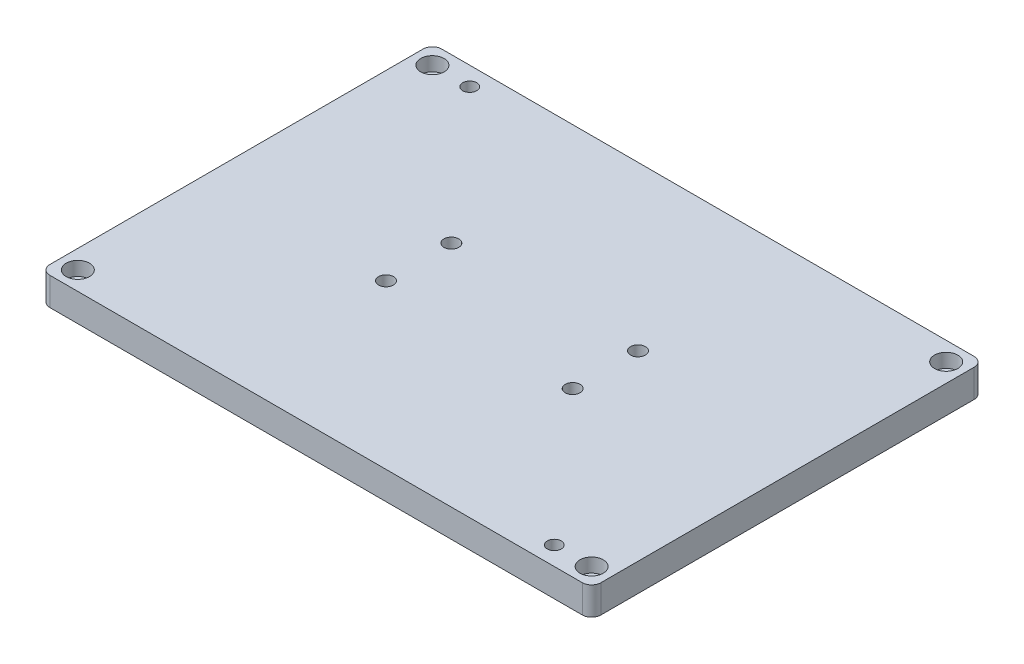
from build123d import *

# Parameters (mm, degrees)
SKETCH1_W                                        = 375.046875
SKETCH1_H                                        = 266.7
BOSS_EXTRUDE1_DEPTH                              = 19.05
CBORE_FOR_3_8_SOCKET_HEAD_CAP_SCREW1_D           = 10.0838
CBORE_FOR_3_8_SOCKET_HEAD_CAP_SCREW1_CBORE_D     = 15.875
CBORE_FOR_3_8_SOCKET_HEAD_CAP_SCREW1_CBORE_DEPTH = 9.525
F_3_8_0_3750_DOWEL_HOLE1_D                       = 9.525
FILLET1_R                                        = 6.35
CBORE_FOR_3_8_SOCKET_HEAD_CAP_SCREW2_D           = 10.0838
CBORE_FOR_3_8_SOCKET_HEAD_CAP_SCREW2_CBORE_D     = 15.875
CBORE_FOR_3_8_SOCKET_HEAD_CAP_SCREW2_CBORE_DEPTH = 9.525


with BuildPart() as part:
    # Sketch1 → Boss-Extrude1 (new body)
    with BuildSketch(Plane(origin=(0, 0, 0), x_dir=(1, 0, 0), z_dir=(0, 1, 0))):
        Rectangle(SKETCH1_W, SKETCH1_H)
    extrude(amount=BOSS_EXTRUDE1_DEPTH)

    # CBORE for 3_8 Socket Head Cap Screw1 (through all)
    with Locations(Plane(origin=(0, 19.05, 0), x_dir=(1, 0, 0), z_dir=(0, 1, 0))):
        with Locations((174.8234375, -120.65), (174.8234375, 120.65), (-174.8234375, -120.65), (-174.8234375, 120.65)):
            CounterBoreHole(CBORE_FOR_3_8_SOCKET_HEAD_CAP_SCREW1_D / 2, CBORE_FOR_3_8_SOCKET_HEAD_CAP_SCREW1_CBORE_D / 2, CBORE_FOR_3_8_SOCKET_HEAD_CAP_SCREW1_CBORE_DEPTH)

    # 3_8 _0.3750_ Dowel Hole1 (through all)
    with Locations(Plane(origin=(0, 19.05, 0), x_dir=(1, 0, 0), z_dir=(0, 1, 0))):
        with Locations((149.4234375, -120.65), (-149.4234375, 120.65)):
            Hole(F_3_8_0_3750_DOWEL_HOLE1_D / 2)

    # Fillet1
    fillet1_edges = [part.edges().sort_by_distance(p)[0] for p in [
        (187.5234375, 9.525, 133.35),
        (-187.5234375, 9.525, 133.35),
        (-187.5234375, 9.525, -133.35),
        (187.5234375, 9.525, -133.35),
    ]]
    fillet(fillet1_edges, radius=FILLET1_R)

    # CBORE for 3_8 Socket Head Cap Screw2 (through all)
    with Locations(Plane(origin=(0, 0, 0), x_dir=(-1, 0, 0), z_dir=(0, -1, 0))):
        with Locations((63.5, -22.225), (63.5, 22.225), (-63.5, -22.225), (-63.5, 22.225)):
            CounterBoreHole(CBORE_FOR_3_8_SOCKET_HEAD_CAP_SCREW2_D / 2, CBORE_FOR_3_8_SOCKET_HEAD_CAP_SCREW2_CBORE_D / 2, CBORE_FOR_3_8_SOCKET_HEAD_CAP_SCREW2_CBORE_DEPTH)


solid = part.part
